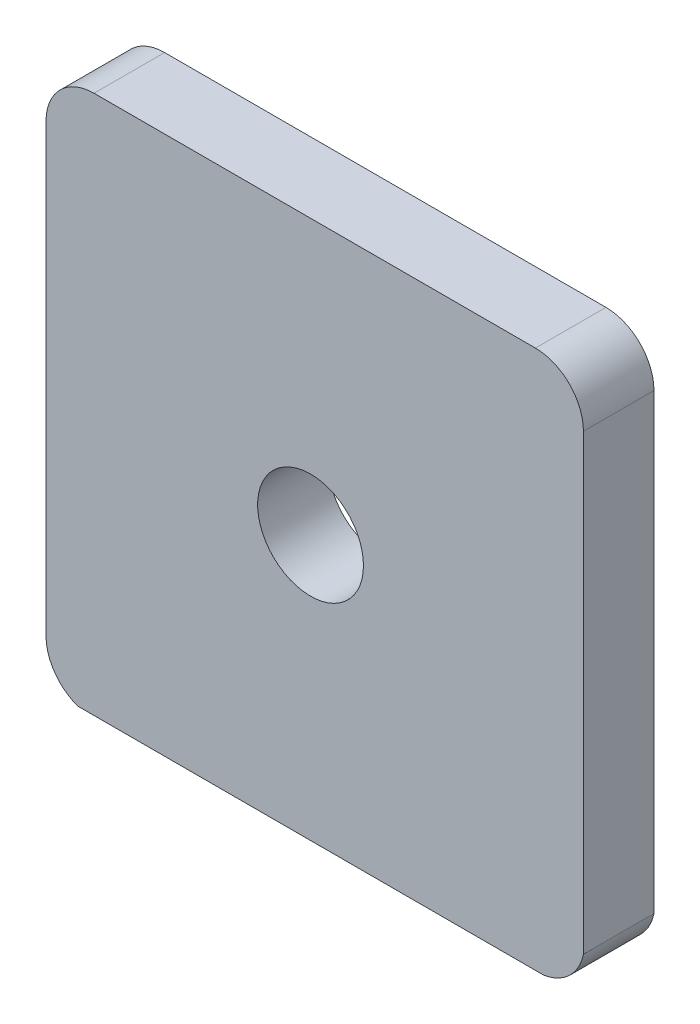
from build123d import *

# Parameters (mm, degrees)
BOSS_EXTRUDE1_DEPTH     = 2.54
CUT_EXTRUDE1_DEPTH      = 2.54
CUT_EXTRUDE1_DEPTH_BACK = 2.54
SKETCH4_R               = 1.905


with BuildPart() as part:
    # Sketch3 → Boss-Extrude1 (new body)
    with BuildSketch(Plane.XY):
        with BuildLine():
            Line((8.097404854, 9.881463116), (-7.795903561, 9.881463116))
            ThreePointArc((-7.795903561, 9.881463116), (-9.018559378, 9.375022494), (-9.525, 8.152366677))
            Line((-9.525, 8.152366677), (-9.525, -7.979518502))
            ThreePointArc((-9.525, -7.979518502), (-9.188699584, -8.925385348), (-8.383575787, -9.525))
            Line((-8.383575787, -9.525), (8.39911697, -9.525))
            ThreePointArc((8.39911697, -9.525), (9.327480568, -9.065355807), (9.826501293, -8.157550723))
            Line((9.826501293, -8.157550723), (9.826501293, 8.152366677))
            ThreePointArc((9.826501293, 8.152366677), (9.320060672, 9.375022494), (8.097404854, 9.881463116))
        make_face()
    extrude(amount=BOSS_EXTRUDE1_DEPTH)

    # Sketch4 → Cut-Extrude1 (cut, two sides: drawn at the far end of the back side and taken through both)
    with BuildSketch(Plane.XY.offset(-CUT_EXTRUDE1_DEPTH_BACK)):
        Circle(SKETCH4_R)
    extrude(amount=CUT_EXTRUDE1_DEPTH + CUT_EXTRUDE1_DEPTH_BACK, mode=Mode.SUBTRACT)


solid = part.part
